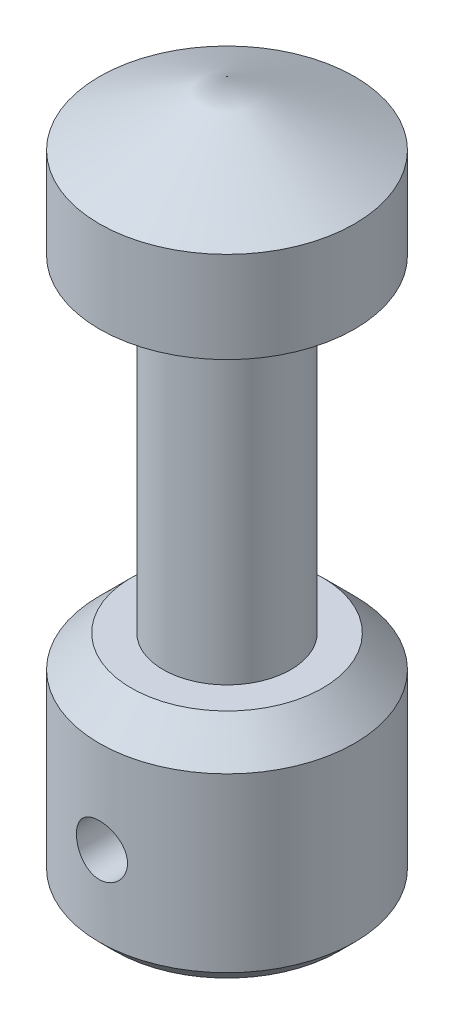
ISO-10303-21;
HEADER;
FILE_DESCRIPTION(('STEP AP214'),'2;1');
FILE_NAME('part.step','',(''),(''),'','','');
FILE_SCHEMA(('AUTOMOTIVE_DESIGN { 1 0 10303 214 1 1 1 1 }'));
ENDSEC;
DATA;
#1=APPLICATION_CONTEXT('core data for automotive mechanical design processes');
#2=APPLICATION_PROTOCOL_DEFINITION('international standard','automotive_design',2000,#1);
#3=PRODUCT_CONTEXT('',#1,'mechanical');
#4=PRODUCT('Part','Part','',(#3));
#5=PRODUCT_RELATED_PRODUCT_CATEGORY('part','',(#4));
#6=PRODUCT_DEFINITION_FORMATION('','',#4);
#7=PRODUCT_DEFINITION_CONTEXT('part definition',#1,'design');
#8=PRODUCT_DEFINITION('design','',#6,#7);
#9=PRODUCT_DEFINITION_SHAPE('','',#8);
#10=(LENGTH_UNIT() NAMED_UNIT(*) SI_UNIT(.MILLI.,.METRE.));
#11=(NAMED_UNIT(*) PLANE_ANGLE_UNIT() SI_UNIT($,.RADIAN.));
#12=(NAMED_UNIT(*) SI_UNIT($,.STERADIAN.) SOLID_ANGLE_UNIT());
#13=UNCERTAINTY_MEASURE_WITH_UNIT(LENGTH_MEASURE(1.E-05),#10,'distance_accuracy_value','');
#14=(GEOMETRIC_REPRESENTATION_CONTEXT(3) GLOBAL_UNCERTAINTY_ASSIGNED_CONTEXT((#13)) GLOBAL_UNIT_ASSIGNED_CONTEXT((#10,
#11,#12)) REPRESENTATION_CONTEXT('',''));
#15=CARTESIAN_POINT('',(0.,0.,0.));
#16=DIRECTION('',(0.,0.,1.));
#17=DIRECTION('',(1.,0.,0.));
#18=AXIS2_PLACEMENT_3D('',#15,#16,#17);
#19=CARTESIAN_POINT('',(0.,-2.,0.));
#20=DIRECTION('',(0.,-1.,0.));
#21=DIRECTION('',(0.,0.,-1.));
#22=AXIS2_PLACEMENT_3D('',#19,#20,#21);
#23=CONICAL_SURFACE('',#22,3.99999999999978,1.10714871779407);
#24=CARTESIAN_POINT('',(0.,0.,3.33066907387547E-13));
#25=VERTEX_POINT('',#24);
#26=VERTEX_LOOP('',#25);
#27=FACE_BOUND('',#26,.T.);
#28=CARTESIAN_POINT('',(0.,-2.,0.));
#29=DIRECTION('',(0.,1.,0.));
#30=DIRECTION('',(0.,0.,1.));
#31=AXIS2_PLACEMENT_3D('',#28,#29,#30);
#32=CIRCLE('',#31,4.);
#33=CARTESIAN_POINT('',(0.,-2.,4.));
#34=VERTEX_POINT('',#33);
#35=EDGE_CURVE('E37',#34,#34,#32,.F.);
#36=ORIENTED_EDGE('',*,*,#35,.F.);
#37=EDGE_LOOP('',(#36));
#38=FACE_BOUND('',#37,.T.);
#39=ADVANCED_FACE('F17',(#27,#38),#23,.T.);
#40=CARTESIAN_POINT('',(0.,0.,0.));
#41=DIRECTION('',(0.,1.,0.));
#42=DIRECTION('',(0.,0.,1.));
#43=AXIS2_PLACEMENT_3D('',#40,#41,#42);
#44=CYLINDRICAL_SURFACE('',#43,4.);
#45=ORIENTED_EDGE('',*,*,#35,.T.);
#46=EDGE_LOOP('',(#45));
#47=FACE_BOUND('',#46,.T.);
#48=CARTESIAN_POINT('',(0.,-4.85738696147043,0.));
#49=DIRECTION('',(0.,1.,0.));
#50=DIRECTION('',(0.,0.,1.));
#51=AXIS2_PLACEMENT_3D('',#48,#49,#50);
#52=CIRCLE('',#51,4.);
#53=CARTESIAN_POINT('',(0.,-4.85738696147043,4.));
#54=VERTEX_POINT('',#53);
#55=EDGE_CURVE('E20',#54,#54,#52,.F.);
#56=ORIENTED_EDGE('',*,*,#55,.F.);
#57=EDGE_LOOP('',(#56));
#58=FACE_BOUND('',#57,.T.);
#59=ADVANCED_FACE('F34',(#47,#58),#44,.T.);
#60=CARTESIAN_POINT('',(-4.,-4.85738696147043,0.));
#61=DIRECTION('',(0.,-1.,0.));
#62=DIRECTION('',(0.,0.,-1.));
#63=AXIS2_PLACEMENT_3D('',#60,#61,#62);
#64=PLANE('',#63);
#65=CARTESIAN_POINT('',(0.,-4.85738696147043,0.));
#66=DIRECTION('',(0.,-1.,0.));
#67=DIRECTION('',(0.,0.,-1.));
#68=AXIS2_PLACEMENT_3D('',#65,#66,#67);
#69=CIRCLE('',#68,2.);
#70=CARTESIAN_POINT('',(0.,-4.85738696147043,-2.));
#71=VERTEX_POINT('',#70);
#72=EDGE_CURVE('E41',#71,#71,#69,.T.);
#73=ORIENTED_EDGE('',*,*,#72,.F.);
#74=EDGE_LOOP('',(#73));
#75=FACE_BOUND('',#74,.T.);
#76=ORIENTED_EDGE('',*,*,#55,.T.);
#77=EDGE_LOOP('',(#76));
#78=FACE_BOUND('',#77,.T.);
#79=ADVANCED_FACE('F127',(#75,#78),#64,.T.);
#80=CARTESIAN_POINT('',(0.,-16.9999999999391,0.));
#81=DIRECTION('',(0.,-1.,0.));
#82=DIRECTION('',(0.,0.,-1.));
#83=AXIS2_PLACEMENT_3D('',#80,#81,#82);
#84=CONICAL_SURFACE('',#83,0.499999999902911,0.443506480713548);
#85=CARTESIAN_POINT('',(0.,-15.9475263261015,0.));
#86=VERTEX_POINT('',#85);
#87=VERTEX_LOOP('',#86);
#88=FACE_BOUND('',#87,.T.);
#89=CARTESIAN_POINT('',(0.,-17.,0.));
#90=DIRECTION('',(0.,1.,0.));
#91=DIRECTION('',(0.,0.,1.));
#92=AXIS2_PLACEMENT_3D('',#89,#90,#91);
#93=CIRCLE('',#92,0.499999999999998);
#94=CARTESIAN_POINT('',(0.,-17.,0.499999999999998));
#95=VERTEX_POINT('',#94);
#96=EDGE_CURVE('E44',#95,#95,#93,.F.);
#97=ORIENTED_EDGE('',*,*,#96,.T.);
#98=EDGE_LOOP('',(#97));
#99=FACE_BOUND('',#98,.T.);
#100=ADVANCED_FACE('F123',(#88,#99),#84,.F.);
#101=CARTESIAN_POINT('',(0.,-21.5,0.));
#102=DIRECTION('',(0.,-1.,0.));
#103=DIRECTION('',(0.,0.,-1.));
#104=AXIS2_PLACEMENT_3D('',#101,#102,#103);
#105=CYLINDRICAL_SURFACE('',#104,2.);
#106=ORIENTED_EDGE('',*,*,#72,.T.);
#107=EDGE_LOOP('',(#106));
#108=FACE_BOUND('',#107,.T.);
#109=CARTESIAN_POINT('',(0.,-15.1028019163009,0.));
#110=DIRECTION('',(0.,-1.,0.));
#111=DIRECTION('',(0.,0.,-1.));
#112=AXIS2_PLACEMENT_3D('',#109,#110,#111);
#113=CIRCLE('',#112,2.);
#114=CARTESIAN_POINT('',(0.,-15.1028019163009,-2.));
#115=VERTEX_POINT('',#114);
#116=EDGE_CURVE('E224',#115,#115,#113,.T.);
#117=ORIENTED_EDGE('',*,*,#116,.F.);
#118=EDGE_LOOP('',(#117));
#119=FACE_BOUND('',#118,.T.);
#120=ADVANCED_FACE('F119',(#108,#119),#105,.T.);
#121=CARTESIAN_POINT('',(0.,0.,0.));
#122=DIRECTION('',(0.,1.,0.));
#123=DIRECTION('',(0.,0.,1.));
#124=AXIS2_PLACEMENT_3D('',#121,#122,#123);
#125=CYLINDRICAL_SURFACE('',#124,0.499999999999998);
#126=CARTESIAN_POINT('',(0.,-18.2,-0.499999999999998));
#127=CARTESIAN_POINT('',(0.025386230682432,-18.2000030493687,-0.499996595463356));
#128=CARTESIAN_POINT('',(0.0508149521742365,-18.2012220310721,-0.498052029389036));
#129=CARTESIAN_POINT('',(0.100908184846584,-18.2059879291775,-0.49037101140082));
#130=CARTESIAN_POINT('',(0.125570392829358,-18.2095412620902,-0.48462410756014));
#131=CARTESIAN_POINT('',(0.173284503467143,-18.2186172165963,-0.469674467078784));
#132=CARTESIAN_POINT('',(0.196344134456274,-18.2241294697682,-0.460489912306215));
#133=CARTESIAN_POINT('',(0.240509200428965,-18.2366632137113,-0.439042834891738));
#134=CARTESIAN_POINT('',(0.261615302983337,-18.2436841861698,-0.426781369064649));
#135=CARTESIAN_POINT('',(0.303188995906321,-18.2593191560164,-0.398445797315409));
#136=CARTESIAN_POINT('',(0.323470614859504,-18.2680156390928,-0.38214524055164));
#137=CARTESIAN_POINT('',(0.361193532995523,-18.2858740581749,-0.346713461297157));
#138=CARTESIAN_POINT('',(0.378630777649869,-18.2950366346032,-0.327578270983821));
#139=CARTESIAN_POINT('',(0.412571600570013,-18.3142783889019,-0.283986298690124));
#140=CARTESIAN_POINT('',(0.428629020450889,-18.3243136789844,-0.259159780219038));
#141=CARTESIAN_POINT('',(0.456296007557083,-18.3426793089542,-0.206573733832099));
#142=CARTESIAN_POINT('',(0.467913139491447,-18.3510125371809,-0.178819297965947));
#143=CARTESIAN_POINT('',(0.48373359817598,-18.3627616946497,-0.128475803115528));
#144=CARTESIAN_POINT('',(0.489078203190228,-18.3668923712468,-0.10641329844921));
#145=CARTESIAN_POINT('',(0.496727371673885,-18.3728745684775,-0.0614776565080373));
#146=CARTESIAN_POINT('',(0.499036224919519,-18.3747293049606,-0.0386057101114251));
#147=CARTESIAN_POINT('',(0.500475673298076,-18.3758804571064,0.00736521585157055));
#148=CARTESIAN_POINT('',(0.499597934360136,-18.3751701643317,0.0304646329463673));
#149=CARTESIAN_POINT('',(0.494705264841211,-18.3712903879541,0.0761240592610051));
#150=CARTESIAN_POINT('',(0.490687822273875,-18.3681189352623,0.0986836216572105));
#151=CARTESIAN_POINT('',(0.47987245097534,-18.3598697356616,0.142175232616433));
#152=CARTESIAN_POINT('',(0.473140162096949,-18.3548372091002,0.163132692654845));
#153=CARTESIAN_POINT('',(0.457160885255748,-18.3434178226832,0.203664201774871));
#154=CARTESIAN_POINT('',(0.447912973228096,-18.3370304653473,0.223237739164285));
#155=CARTESIAN_POINT('',(0.42517897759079,-18.3221803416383,0.264334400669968));
#156=CARTESIAN_POINT('',(0.411223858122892,-18.3135527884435,0.285538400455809));
#157=CARTESIAN_POINT('',(0.380350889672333,-18.2959762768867,0.325533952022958));
#158=CARTESIAN_POINT('',(0.36343028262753,-18.2870270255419,0.344323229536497));
#159=CARTESIAN_POINT('',(0.323814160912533,-18.2680833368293,0.382114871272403));
#160=CARTESIAN_POINT('',(0.300626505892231,-18.2581595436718,0.400642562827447));
#161=CARTESIAN_POINT('',(0.250873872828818,-18.2398926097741,0.433532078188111));
#162=CARTESIAN_POINT('',(0.224308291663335,-18.2315497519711,0.447893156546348));
#163=CARTESIAN_POINT('',(0.169920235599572,-18.2177774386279,0.47112068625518));
#164=CARTESIAN_POINT('',(0.142239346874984,-18.2122168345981,0.480238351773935));
#165=CARTESIAN_POINT('',(0.0853578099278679,-18.204053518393,0.493517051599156));
#166=CARTESIAN_POINT('',(0.0561638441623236,-18.2014387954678,0.497698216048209));
#167=CARTESIAN_POINT('',(0.0179027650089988,-18.2001491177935,0.499760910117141));
#168=CARTESIAN_POINT('',(0.00895402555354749,-18.1999989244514,0.500001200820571));
#169=CARTESIAN_POINT('',(-0.0253862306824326,-18.2000030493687,0.499996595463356));
#170=CARTESIAN_POINT('',(-0.0508149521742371,-18.2012220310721,0.498052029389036));
#171=CARTESIAN_POINT('',(-0.100908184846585,-18.2059879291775,0.49037101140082));
#172=CARTESIAN_POINT('',(-0.125570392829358,-18.2095412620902,0.48462410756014));
#173=CARTESIAN_POINT('',(-0.173284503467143,-18.2186172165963,0.469674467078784));
#174=CARTESIAN_POINT('',(-0.196344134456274,-18.2241294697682,0.460489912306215));
#175=CARTESIAN_POINT('',(-0.240509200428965,-18.2366632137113,0.439042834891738));
#176=CARTESIAN_POINT('',(-0.261615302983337,-18.2436841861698,0.426781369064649));
#177=CARTESIAN_POINT('',(-0.303188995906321,-18.2593191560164,0.398445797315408));
#178=CARTESIAN_POINT('',(-0.323470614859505,-18.2680156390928,0.382145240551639));
#179=CARTESIAN_POINT('',(-0.361193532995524,-18.2858740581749,0.346713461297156));
#180=CARTESIAN_POINT('',(-0.37863077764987,-18.2950366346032,0.32757827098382));
#181=CARTESIAN_POINT('',(-0.412571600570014,-18.3142783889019,0.283986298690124));
#182=CARTESIAN_POINT('',(-0.428629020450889,-18.3243136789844,0.259159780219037));
#183=CARTESIAN_POINT('',(-0.456296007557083,-18.3426793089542,0.206573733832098));
#184=CARTESIAN_POINT('',(-0.467913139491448,-18.3510125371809,0.178819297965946));
#185=CARTESIAN_POINT('',(-0.48373359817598,-18.3627616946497,0.128475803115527));
#186=CARTESIAN_POINT('',(-0.489078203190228,-18.3668923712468,0.106413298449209));
#187=CARTESIAN_POINT('',(-0.496727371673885,-18.3728745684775,0.0614776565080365));
#188=CARTESIAN_POINT('',(-0.499036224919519,-18.3747293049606,0.0386057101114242));
#189=CARTESIAN_POINT('',(-0.500475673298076,-18.3758804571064,-0.00736521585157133));
#190=CARTESIAN_POINT('',(-0.499597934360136,-18.3751701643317,-0.0304646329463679));
#191=CARTESIAN_POINT('',(-0.494705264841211,-18.3712903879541,-0.0761240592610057));
#192=CARTESIAN_POINT('',(-0.490687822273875,-18.3681189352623,-0.0986836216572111));
#193=CARTESIAN_POINT('',(-0.479872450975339,-18.3598697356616,-0.142175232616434));
#194=CARTESIAN_POINT('',(-0.473140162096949,-18.3548372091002,-0.163132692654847));
#195=CARTESIAN_POINT('',(-0.457160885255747,-18.3434178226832,-0.203664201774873));
#196=CARTESIAN_POINT('',(-0.447912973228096,-18.3370304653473,-0.223237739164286));
#197=CARTESIAN_POINT('',(-0.42517897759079,-18.3221803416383,-0.264334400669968));
#198=CARTESIAN_POINT('',(-0.411223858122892,-18.3135527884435,-0.285538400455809));
#199=CARTESIAN_POINT('',(-0.380350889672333,-18.2959762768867,-0.325533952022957));
#200=CARTESIAN_POINT('',(-0.36343028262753,-18.2870270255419,-0.344323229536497));
#201=CARTESIAN_POINT('',(-0.323814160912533,-18.2680833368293,-0.382114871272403));
#202=CARTESIAN_POINT('',(-0.30062650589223,-18.2581595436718,-0.400642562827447));
#203=CARTESIAN_POINT('',(-0.250873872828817,-18.2398926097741,-0.433532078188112));
#204=CARTESIAN_POINT('',(-0.224308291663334,-18.2315497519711,-0.447893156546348));
#205=CARTESIAN_POINT('',(-0.169920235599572,-18.2177774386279,-0.47112068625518));
#206=CARTESIAN_POINT('',(-0.142239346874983,-18.2122168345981,-0.480238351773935));
#207=CARTESIAN_POINT('',(-0.0853578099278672,-18.204053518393,-0.493517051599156));
#208=CARTESIAN_POINT('',(-0.0561638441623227,-18.2014387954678,-0.497698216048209));
#209=CARTESIAN_POINT('',(-0.0179027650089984,-18.2001491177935,-0.499760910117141));
#210=CARTESIAN_POINT('',(-0.00895402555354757,-18.1999989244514,-0.500001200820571));
#211=CARTESIAN_POINT('',(0.,-18.2,-0.499999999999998));
#212=B_SPLINE_CURVE_WITH_KNOTS('',3,(#126,#127,#128,#129,#130,#131,#132,#133,#134,#135,#136,
#137,#138,#139,#140,#141,#142,#143,#144,#145,#146,#147,#148,#149,#150,#151,#152,#153,#154,#155,
#156,#157,#158,#159,#160,#161,#162,#163,#164,#165,#166,#167,#168,#169,#170,#171,#172,#173,#174,
#175,#176,#177,#178,#179,#180,#181,#182,#183,#184,#185,#186,#187,#188,#189,#190,#191,#192,#193,
#194,#195,#196,#197,#198,#199,#200,#201,#202,#203,#204,#205,#206,#207,#208,#209,#210,#211),
.UNSPECIFIED.,.T.,.F.,(4,2,2,2,2,2,2,2,2,2,2,2,2,2,2,2,2,2,2,2,2,2,2,2,2,2,2,2,2,2,2,2,2,2,2,2,
2,2,2,2,2,2,4),(0.,0.0761325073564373,0.152475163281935,0.228419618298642,0.304338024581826,
0.38632633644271,0.468430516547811,0.561652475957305,0.654714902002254,0.723647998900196,
0.792483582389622,0.861499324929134,0.930570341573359,0.998062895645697,1.06558027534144,
1.14571372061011,1.22592209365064,1.31934197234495,1.41277855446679,1.501255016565,
1.58936942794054,1.61622226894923,1.69235477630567,1.76869743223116,1.84464188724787,
1.92056029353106,2.00254860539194,2.08465278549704,2.17787474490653,2.27093717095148,
2.33987026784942,2.40870585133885,2.47772159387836,2.54679261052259,2.61428516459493,
2.68180254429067,2.76193598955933,2.84214436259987,2.93556424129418,3.02900082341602,
3.11747728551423,3.20559169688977,3.23244453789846),.UNSPECIFIED.);
#213=CARTESIAN_POINT('',(0.,-18.2,-0.499999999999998));
#214=VERTEX_POINT('',#213);
#215=EDGE_CURVE('E104',#214,#214,#212,.T.);
#216=ORIENTED_EDGE('',*,*,#215,.T.);
#217=EDGE_LOOP('',(#216));
#218=FACE_BOUND('',#217,.T.);
#219=ORIENTED_EDGE('',*,*,#96,.F.);
#220=EDGE_LOOP('',(#219));
#221=FACE_BOUND('',#220,.T.);
#222=ADVANCED_FACE('F114',(#218,#221),#125,.F.);
#223=CARTESIAN_POINT('',(0.,0.,0.));
#224=DIRECTION('',(0.,1.,0.));
#225=DIRECTION('',(0.,0.,1.));
#226=AXIS2_PLACEMENT_3D('',#223,#224,#225);
#227=CYLINDRICAL_SURFACE('',#226,0.499999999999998);
#228=CARTESIAN_POINT('',(0.,-19.8,-0.499999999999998));
#229=CARTESIAN_POINT('',(-0.0253862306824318,-19.7999969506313,-0.499996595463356));
#230=CARTESIAN_POINT('',(-0.0508149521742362,-19.7987779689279,-0.498052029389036));
#231=CARTESIAN_POINT('',(-0.100908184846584,-19.7940120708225,-0.49037101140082));
#232=CARTESIAN_POINT('',(-0.125570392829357,-19.7904587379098,-0.48462410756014));
#233=CARTESIAN_POINT('',(-0.173284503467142,-19.7813827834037,-0.469674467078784));
#234=CARTESIAN_POINT('',(-0.196344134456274,-19.7758705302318,-0.460489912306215));
#235=CARTESIAN_POINT('',(-0.240509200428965,-19.7633367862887,-0.439042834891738));
#236=CARTESIAN_POINT('',(-0.261615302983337,-19.7563158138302,-0.426781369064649));
#237=CARTESIAN_POINT('',(-0.303188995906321,-19.7406808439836,-0.398445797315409));
#238=CARTESIAN_POINT('',(-0.323470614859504,-19.7319843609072,-0.38214524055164));
#239=CARTESIAN_POINT('',(-0.361193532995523,-19.7141259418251,-0.346713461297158));
#240=CARTESIAN_POINT('',(-0.378630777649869,-19.7049633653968,-0.327578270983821));
#241=CARTESIAN_POINT('',(-0.412571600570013,-19.6857216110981,-0.283986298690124));
#242=CARTESIAN_POINT('',(-0.428629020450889,-19.6756863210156,-0.259159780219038));
#243=CARTESIAN_POINT('',(-0.456296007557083,-19.6573206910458,-0.206573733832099));
#244=CARTESIAN_POINT('',(-0.467913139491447,-19.6489874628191,-0.178819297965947));
#245=CARTESIAN_POINT('',(-0.48373359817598,-19.6372383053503,-0.128475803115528));
#246=CARTESIAN_POINT('',(-0.489078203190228,-19.6331076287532,-0.106413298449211));
#247=CARTESIAN_POINT('',(-0.496727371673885,-19.6271254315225,-0.0614776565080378));
#248=CARTESIAN_POINT('',(-0.499036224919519,-19.6252706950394,-0.0386057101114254));
#249=CARTESIAN_POINT('',(-0.500475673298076,-19.6241195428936,0.00736521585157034));
#250=CARTESIAN_POINT('',(-0.499597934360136,-19.6248298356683,0.0304646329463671));
#251=CARTESIAN_POINT('',(-0.494705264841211,-19.6287096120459,0.0761240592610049));
#252=CARTESIAN_POINT('',(-0.490687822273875,-19.6318810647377,0.0986836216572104));
#253=CARTESIAN_POINT('',(-0.47987245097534,-19.6401302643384,0.142175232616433));
#254=CARTESIAN_POINT('',(-0.47314016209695,-19.6451627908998,0.163132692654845));
#255=CARTESIAN_POINT('',(-0.457160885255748,-19.6565821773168,0.203664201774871));
#256=CARTESIAN_POINT('',(-0.447912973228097,-19.6629695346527,0.223237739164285));
#257=CARTESIAN_POINT('',(-0.42517897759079,-19.6778196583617,0.264334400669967));
#258=CARTESIAN_POINT('',(-0.411223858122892,-19.6864472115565,0.285538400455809));
#259=CARTESIAN_POINT('',(-0.380350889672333,-19.7040237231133,0.325533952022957));
#260=CARTESIAN_POINT('',(-0.36343028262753,-19.7129729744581,0.344323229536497));
#261=CARTESIAN_POINT('',(-0.323814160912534,-19.7319166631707,0.382114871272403));
#262=CARTESIAN_POINT('',(-0.300626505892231,-19.7418404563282,0.400642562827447));
#263=CARTESIAN_POINT('',(-0.250873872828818,-19.7601073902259,0.433532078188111));
#264=CARTESIAN_POINT('',(-0.224308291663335,-19.7684502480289,0.447893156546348));
#265=CARTESIAN_POINT('',(-0.169920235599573,-19.7822225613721,0.47112068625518));
#266=CARTESIAN_POINT('',(-0.142239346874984,-19.7877831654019,0.480238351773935));
#267=CARTESIAN_POINT('',(-0.0853578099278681,-19.795946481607,0.493517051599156));
#268=CARTESIAN_POINT('',(-0.0561638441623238,-19.7985612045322,0.497698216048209));
#269=CARTESIAN_POINT('',(-0.017902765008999,-19.7998508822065,0.499760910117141));
#270=CARTESIAN_POINT('',(-0.0089540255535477,-19.8000010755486,0.500001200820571));
#271=CARTESIAN_POINT('',(0.0253862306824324,-19.7999969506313,0.499996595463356));
#272=CARTESIAN_POINT('',(0.0508149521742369,-19.7987779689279,0.498052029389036));
#273=CARTESIAN_POINT('',(0.100908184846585,-19.7940120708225,0.49037101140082));
#274=CARTESIAN_POINT('',(0.125570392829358,-19.7904587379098,0.48462410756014));
#275=CARTESIAN_POINT('',(0.173284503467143,-19.7813827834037,0.469674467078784));
#276=CARTESIAN_POINT('',(0.196344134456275,-19.7758705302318,0.460489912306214));
#277=CARTESIAN_POINT('',(0.240509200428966,-19.7633367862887,0.439042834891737));
#278=CARTESIAN_POINT('',(0.261615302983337,-19.7563158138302,0.426781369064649));
#279=CARTESIAN_POINT('',(0.303188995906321,-19.7406808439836,0.398445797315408));
#280=CARTESIAN_POINT('',(0.323470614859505,-19.7319843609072,0.382145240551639));
#281=CARTESIAN_POINT('',(0.361193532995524,-19.7141259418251,0.346713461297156));
#282=CARTESIAN_POINT('',(0.37863077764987,-19.7049633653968,0.32757827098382));
#283=CARTESIAN_POINT('',(0.412571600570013,-19.6857216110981,0.283986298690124));
#284=CARTESIAN_POINT('',(0.428629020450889,-19.6756863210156,0.259159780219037));
#285=CARTESIAN_POINT('',(0.456296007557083,-19.6573206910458,0.206573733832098));
#286=CARTESIAN_POINT('',(0.467913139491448,-19.6489874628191,0.178819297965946));
#287=CARTESIAN_POINT('',(0.48373359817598,-19.6372383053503,0.128475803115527));
#288=CARTESIAN_POINT('',(0.489078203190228,-19.6331076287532,0.106413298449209));
#289=CARTESIAN_POINT('',(0.496727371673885,-19.6271254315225,0.0614776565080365));
#290=CARTESIAN_POINT('',(0.499036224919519,-19.6252706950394,0.0386057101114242));
#291=CARTESIAN_POINT('',(0.500475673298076,-19.6241195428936,-0.00736521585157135));
#292=CARTESIAN_POINT('',(0.499597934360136,-19.6248298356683,-0.0304646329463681));
#293=CARTESIAN_POINT('',(0.49470526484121,-19.6287096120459,-0.0761240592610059));
#294=CARTESIAN_POINT('',(0.490687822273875,-19.6318810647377,-0.0986836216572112));
#295=CARTESIAN_POINT('',(0.479872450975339,-19.6401302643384,-0.142175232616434));
#296=CARTESIAN_POINT('',(0.473140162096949,-19.6451627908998,-0.163132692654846));
#297=CARTESIAN_POINT('',(0.457160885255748,-19.6565821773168,-0.203664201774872));
#298=CARTESIAN_POINT('',(0.447912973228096,-19.6629695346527,-0.223237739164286));
#299=CARTESIAN_POINT('',(0.42517897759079,-19.6778196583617,-0.264334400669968));
#300=CARTESIAN_POINT('',(0.411223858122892,-19.6864472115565,-0.285538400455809));
#301=CARTESIAN_POINT('',(0.380350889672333,-19.7040237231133,-0.325533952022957));
#302=CARTESIAN_POINT('',(0.363430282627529,-19.7129729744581,-0.344323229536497));
#303=CARTESIAN_POINT('',(0.323814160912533,-19.7319166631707,-0.382114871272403));
#304=CARTESIAN_POINT('',(0.30062650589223,-19.7418404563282,-0.400642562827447));
#305=CARTESIAN_POINT('',(0.250873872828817,-19.7601073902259,-0.433532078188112));
#306=CARTESIAN_POINT('',(0.224308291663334,-19.7684502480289,-0.447893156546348));
#307=CARTESIAN_POINT('',(0.169920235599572,-19.7822225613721,-0.47112068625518));
#308=CARTESIAN_POINT('',(0.142239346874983,-19.7877831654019,-0.480238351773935));
#309=CARTESIAN_POINT('',(0.085357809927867,-19.795946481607,-0.493517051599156));
#310=CARTESIAN_POINT('',(0.0561638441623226,-19.7985612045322,-0.497698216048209));
#311=CARTESIAN_POINT('',(0.0179027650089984,-19.7998508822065,-0.499760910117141));
#312=CARTESIAN_POINT('',(0.00895402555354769,-19.8000010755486,-0.500001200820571));
#313=CARTESIAN_POINT('',(0.,-19.8,-0.499999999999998));
#314=B_SPLINE_CURVE_WITH_KNOTS('',3,(#228,#229,#230,#231,#232,#233,#234,#235,#236,#237,#238,
#239,#240,#241,#242,#243,#244,#245,#246,#247,#248,#249,#250,#251,#252,#253,#254,#255,#256,#257,
#258,#259,#260,#261,#262,#263,#264,#265,#266,#267,#268,#269,#270,#271,#272,#273,#274,#275,#276,
#277,#278,#279,#280,#281,#282,#283,#284,#285,#286,#287,#288,#289,#290,#291,#292,#293,#294,#295,
#296,#297,#298,#299,#300,#301,#302,#303,#304,#305,#306,#307,#308,#309,#310,#311,#312,#313),
.UNSPECIFIED.,.T.,.F.,(4,2,2,2,2,2,2,2,2,2,2,2,2,2,2,2,2,2,2,2,2,2,2,2,2,2,2,2,2,2,2,2,2,2,2,2,
2,2,2,2,2,2,4),(0.,0.0761325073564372,0.152475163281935,0.228419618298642,0.304338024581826,
0.38632633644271,0.468430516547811,0.561652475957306,0.654714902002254,0.723647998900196,
0.792483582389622,0.861499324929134,0.930570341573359,0.998062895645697,1.06558027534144,
1.14571372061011,1.22592209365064,1.31934197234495,1.41277855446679,1.501255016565,
1.58936942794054,1.61622226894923,1.69235477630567,1.76869743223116,1.84464188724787,
1.92056029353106,2.00254860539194,2.08465278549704,2.17787474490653,2.27093717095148,
2.33987026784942,2.40870585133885,2.47772159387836,2.54679261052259,2.61428516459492,
2.68180254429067,2.76193598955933,2.84214436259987,2.93556424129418,3.02900082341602,
3.11747728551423,3.20559169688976,3.23244453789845),.UNSPECIFIED.);
#315=CARTESIAN_POINT('',(0.,-19.8,-0.499999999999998));
#316=VERTEX_POINT('',#315);
#317=EDGE_CURVE('E96',#316,#316,#314,.T.);
#318=ORIENTED_EDGE('',*,*,#317,.T.);
#319=EDGE_LOOP('',(#318));
#320=FACE_BOUND('',#319,.T.);
#321=CARTESIAN_POINT('',(0.,-22.,0.));
#322=DIRECTION('',(0.,1.,0.));
#323=DIRECTION('',(0.,0.,1.));
#324=AXIS2_PLACEMENT_3D('',#321,#322,#323);
#325=CIRCLE('',#324,0.499999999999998);
#326=CARTESIAN_POINT('',(0.,-22.,0.499999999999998));
#327=VERTEX_POINT('',#326);
#328=EDGE_CURVE('E226',#327,#327,#325,.T.);
#329=ORIENTED_EDGE('',*,*,#328,.F.);
#330=EDGE_LOOP('',(#329));
#331=FACE_BOUND('',#330,.T.);
#332=ADVANCED_FACE('F109',(#320,#331),#227,.F.);
#333=CARTESIAN_POINT('',(-0.499999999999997,-22.,0.));
#334=DIRECTION('',(0.,-1.,0.));
#335=DIRECTION('',(0.,0.,-1.));
#336=AXIS2_PLACEMENT_3D('',#333,#334,#335);
#337=PLANE('',#336);
#338=ORIENTED_EDGE('',*,*,#328,.T.);
#339=EDGE_LOOP('',(#338));
#340=FACE_BOUND('',#339,.T.);
#341=CARTESIAN_POINT('',(0.,-21.9999999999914,0.));
#342=DIRECTION('',(0.,1.,0.));
#343=DIRECTION('',(0.,0.,1.));
#344=AXIS2_PLACEMENT_3D('',#341,#342,#343);
#345=CIRCLE('',#344,3.49999999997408);
#346=CARTESIAN_POINT('',(0.,-21.9999999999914,3.49999999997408));
#347=VERTEX_POINT('',#346);
#348=EDGE_CURVE('E82',#347,#347,#345,.T.);
#349=ORIENTED_EDGE('',*,*,#348,.F.);
#350=EDGE_LOOP('',(#349));
#351=FACE_BOUND('',#350,.T.);
#352=ADVANCED_FACE('F113',(#340,#351),#337,.T.);
#353=CARTESIAN_POINT('',(-4.,-15.1028019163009,0.));
#354=DIRECTION('',(0.,1.,0.));
#355=DIRECTION('',(0.,0.,1.));
#356=AXIS2_PLACEMENT_3D('',#353,#354,#355);
#357=PLANE('',#356);
#358=ORIENTED_EDGE('',*,*,#116,.T.);
#359=EDGE_LOOP('',(#358));
#360=FACE_BOUND('',#359,.T.);
#361=CARTESIAN_POINT('',(0.,-15.1028019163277,0.));
#362=DIRECTION('',(0.,-1.,0.));
#363=DIRECTION('',(0.,0.,-1.));
#364=AXIS2_PLACEMENT_3D('',#361,#362,#363);
#365=CIRCLE('',#364,3.00000000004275);
#366=CARTESIAN_POINT('',(0.,-15.1028019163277,-3.00000000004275));
#367=VERTEX_POINT('',#366);
#368=EDGE_CURVE('E93',#367,#367,#365,.T.);
#369=ORIENTED_EDGE('',*,*,#368,.F.);
#370=EDGE_LOOP('',(#369));
#371=FACE_BOUND('',#370,.T.);
#372=ADVANCED_FACE('F77',(#360,#371),#357,.T.);
#373=CARTESIAN_POINT('',(0.,-19.,-4.));
#374=DIRECTION('',(0.,0.,1.));
#375=DIRECTION('',(1.,0.,0.));
#376=AXIS2_PLACEMENT_3D('',#373,#374,#375);
#377=CYLINDRICAL_SURFACE('',#376,0.8);
#378=CARTESIAN_POINT('',(0.,-18.2,4.));
#379=CARTESIAN_POINT('',(0.0444528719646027,-18.2000019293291,3.99999903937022));
#380=CARTESIAN_POINT('',(0.088932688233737,-18.2037183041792,3.99925121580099));
#381=CARTESIAN_POINT('',(0.176641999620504,-18.2184762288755,3.99633945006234));
#382=CARTESIAN_POINT('',(0.219870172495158,-18.229525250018,3.99417406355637));
#383=CARTESIAN_POINT('',(0.303785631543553,-18.2585936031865,3.98866907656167));
#384=CARTESIAN_POINT('',(0.344475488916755,-18.2766057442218,3.98533068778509));
#385=CARTESIAN_POINT('',(0.422249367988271,-18.3190677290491,3.97784286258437));
#386=CARTESIAN_POINT('',(0.459333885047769,-18.3435166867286,3.97369353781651));
#387=CARTESIAN_POINT('',(0.529350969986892,-18.3985077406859,3.96497779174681));
#388=CARTESIAN_POINT('',(0.562228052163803,-18.4291197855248,3.96040694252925));
#389=CARTESIAN_POINT('',(0.622423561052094,-18.4954265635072,3.951394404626));
#390=CARTESIAN_POINT('',(0.649740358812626,-18.531122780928,3.9469527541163));
#391=CARTESIAN_POINT('',(0.698278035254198,-18.6069917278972,3.93865733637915));
#392=CARTESIAN_POINT('',(0.71943843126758,-18.6472038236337,3.93480956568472));
#393=CARTESIAN_POINT('',(0.754659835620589,-18.7306753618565,3.92820730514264));
#394=CARTESIAN_POINT('',(0.768728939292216,-18.7739312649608,3.9254515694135));
#395=CARTESIAN_POINT('',(0.785993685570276,-18.847845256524,3.92202265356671));
#396=CARTESIAN_POINT('',(0.791237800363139,-18.8780229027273,3.92096360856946));
#397=CARTESIAN_POINT('',(0.798241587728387,-18.9387961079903,3.91954372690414));
#398=CARTESIAN_POINT('',(0.800001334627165,-18.9693916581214,3.91918287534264));
#399=CARTESIAN_POINT('',(0.799998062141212,-19.0444428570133,3.91918462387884));
#400=CARTESIAN_POINT('',(0.796283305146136,-19.0889126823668,3.91994793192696));
#401=CARTESIAN_POINT('',(0.78153239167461,-19.176601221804,3.92291491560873));
#402=CARTESIAN_POINT('',(0.770488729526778,-19.2198186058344,3.92512006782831));
#403=CARTESIAN_POINT('',(0.74143604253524,-19.3037112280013,3.93071110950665));
#404=CARTESIAN_POINT('',(0.723434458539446,-19.3443891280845,3.93409573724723));
#405=CARTESIAN_POINT('',(0.680997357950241,-19.4221428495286,3.94166271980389));
#406=CARTESIAN_POINT('',(0.656562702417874,-19.4592191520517,3.94584496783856));
#407=CARTESIAN_POINT('',(0.601586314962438,-19.5292449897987,3.954601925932));
#408=CARTESIAN_POINT('',(0.570971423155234,-19.5621365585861,3.95918092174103));
#409=CARTESIAN_POINT('',(0.504652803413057,-19.6223601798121,3.96817882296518));
#410=CARTESIAN_POINT('',(0.468947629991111,-19.6496906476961,3.97259768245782));
#411=CARTESIAN_POINT('',(0.393070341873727,-19.6982430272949,3.98082454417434));
#412=CARTESIAN_POINT('',(0.352860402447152,-19.7194068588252,3.98462659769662));
#413=CARTESIAN_POINT('',(0.269393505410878,-19.7546352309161,3.99113669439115));
#414=CARTESIAN_POINT('',(0.226140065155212,-19.76870781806,3.99384597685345));
#415=CARTESIAN_POINT('',(0.152216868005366,-19.7859821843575,3.99721451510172));
#416=CARTESIAN_POINT('',(0.122026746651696,-19.7912306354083,3.99825387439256));
#417=CARTESIAN_POINT('',(0.0612286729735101,-19.7982401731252,3.99964694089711));
#418=CARTESIAN_POINT('',(0.0306207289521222,-19.8000013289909,4.00000066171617));
#419=CARTESIAN_POINT('',(-0.0444528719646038,-19.7999980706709,3.99999903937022));
#420=CARTESIAN_POINT('',(-0.0889326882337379,-19.7962816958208,3.99925121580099));
#421=CARTESIAN_POINT('',(-0.176641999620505,-19.7815237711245,3.99633945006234));
#422=CARTESIAN_POINT('',(-0.219870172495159,-19.770474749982,3.99417406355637));
#423=CARTESIAN_POINT('',(-0.303785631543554,-19.7414063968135,3.98866907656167));
#424=CARTESIAN_POINT('',(-0.344475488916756,-19.7233942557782,3.98533068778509));
#425=CARTESIAN_POINT('',(-0.422249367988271,-19.6809322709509,3.97784286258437));
#426=CARTESIAN_POINT('',(-0.459333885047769,-19.6564833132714,3.97369353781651));
#427=CARTESIAN_POINT('',(-0.529350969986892,-19.6014922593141,3.96497779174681));
#428=CARTESIAN_POINT('',(-0.562228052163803,-19.5708802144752,3.96040694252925));
#429=CARTESIAN_POINT('',(-0.622423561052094,-19.5045734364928,3.951394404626));
#430=CARTESIAN_POINT('',(-0.649740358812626,-19.468877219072,3.9469527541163));
#431=CARTESIAN_POINT('',(-0.698278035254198,-19.3930082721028,3.93865733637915));
#432=CARTESIAN_POINT('',(-0.71943843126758,-19.3527961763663,3.93480956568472));
#433=CARTESIAN_POINT('',(-0.754659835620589,-19.2693246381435,3.92820730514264));
#434=CARTESIAN_POINT('',(-0.768728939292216,-19.2260687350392,3.9254515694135));
#435=CARTESIAN_POINT('',(-0.785993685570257,-19.1521547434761,3.92202265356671));
#436=CARTESIAN_POINT('',(-0.79123780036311,-19.1219770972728,3.92096360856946));
#437=CARTESIAN_POINT('',(-0.798241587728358,-19.06120389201,3.91954372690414));
#438=CARTESIAN_POINT('',(-0.800001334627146,-19.030608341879,3.91918287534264));
#439=CARTESIAN_POINT('',(-0.799998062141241,-18.9555571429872,3.91918462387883));
#440=CARTESIAN_POINT('',(-0.796283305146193,-18.9110873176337,3.91994793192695));
#441=CARTESIAN_POINT('',(-0.781532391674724,-18.8233987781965,3.9229149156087));
#442=CARTESIAN_POINT('',(-0.770488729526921,-18.7801813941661,3.92512006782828));
#443=CARTESIAN_POINT('',(-0.741436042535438,-18.6962887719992,3.93071110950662));
#444=CARTESIAN_POINT('',(-0.723434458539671,-18.655610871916,3.93409573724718));
#445=CARTESIAN_POINT('',(-0.680997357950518,-18.5778571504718,3.94166271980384));
#446=CARTESIAN_POINT('',(-0.656562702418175,-18.5407808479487,3.94584496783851));
#447=CARTESIAN_POINT('',(-0.601586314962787,-18.4707550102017,3.95460192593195));
#448=CARTESIAN_POINT('',(-0.570971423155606,-18.4378634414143,3.95918092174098));
#449=CARTESIAN_POINT('',(-0.504652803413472,-18.3776398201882,3.96817882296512));
#450=CARTESIAN_POINT('',(-0.468947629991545,-18.3503093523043,3.97259768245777));
#451=CARTESIAN_POINT('',(-0.393070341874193,-18.3017569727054,3.9808245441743));
#452=CARTESIAN_POINT('',(-0.352860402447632,-18.2805931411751,3.98462659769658));
#453=CARTESIAN_POINT('',(-0.269393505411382,-18.2453647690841,3.99113669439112));
#454=CARTESIAN_POINT('',(-0.226140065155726,-18.2312921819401,3.99384597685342));
#455=CARTESIAN_POINT('',(-0.152216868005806,-18.2140178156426,3.99721451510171));
#456=CARTESIAN_POINT('',(-0.12202674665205,-18.2087693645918,3.99825387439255));
#457=CARTESIAN_POINT('',(-0.0612286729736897,-18.2017598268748,3.99964694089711));
#458=CARTESIAN_POINT('',(-0.0306207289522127,-18.1999986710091,4.00000066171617));
#459=CARTESIAN_POINT('',(0.,-18.2,4.));
#460=B_SPLINE_CURVE_WITH_KNOTS('',3,(#378,#379,#380,#381,#382,#383,#384,#385,#386,#387,#388,
#389,#390,#391,#392,#393,#394,#395,#396,#397,#398,#399,#400,#401,#402,#403,#404,#405,#406,#407,
#408,#409,#410,#411,#412,#413,#414,#415,#416,#417,#418,#419,#420,#421,#422,#423,#424,#425,#426,
#427,#428,#429,#430,#431,#432,#433,#434,#435,#436,#437,#438,#439,#440,#441,#442,#443,#444,#445,
#446,#447,#448,#449,#450,#451,#452,#453,#454,#455,#456,#457,#458,#459),.UNSPECIFIED.,.T.,.F.,(4,
2,2,2,2,2,2,2,2,2,2,2,2,2,2,2,2,2,2,2,2,2,2,2,2,2,2,2,2,2,2,2,2,2,2,2,2,2,2,2,4),(0.,
0.133245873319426,0.266627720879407,0.399872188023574,0.53309832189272,0.667931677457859,
0.802804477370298,0.93896073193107,1.07496119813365,1.16671049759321,1.25845783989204,
1.39167361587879,1.52502603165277,1.65823623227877,1.79142861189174,1.9263013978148,
2.06121256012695,2.19735609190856,2.33334478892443,2.42513113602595,2.5169156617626,
2.65016153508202,2.783543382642,2.91678784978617,3.05001398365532,3.18484733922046,
3.31972013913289,3.45587639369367,3.59187685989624,3.68362615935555,3.77537350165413,
3.90858927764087,4.04194169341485,4.17515189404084,4.30834427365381,4.44321705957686,
4.57812822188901,4.71427175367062,4.85026045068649,4.94204679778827,5.03383132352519),.UNSPECIFIED.);
#461=CARTESIAN_POINT('',(0.,-18.2,4.));
#462=VERTEX_POINT('',#461);
#463=EDGE_CURVE('E46',#462,#462,#460,.T.);
#464=ORIENTED_EDGE('',*,*,#463,.F.);
#465=EDGE_LOOP('',(#464));
#466=FACE_BOUND('',#465,.T.);
#467=CARTESIAN_POINT('',(0.8,-18.9999999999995,-3.91918358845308));
#468=CARTESIAN_POINT('',(0.799998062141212,-18.9555571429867,-3.91918462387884));
#469=CARTESIAN_POINT('',(0.796283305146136,-18.9110873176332,-3.91994793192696));
#470=CARTESIAN_POINT('',(0.78153239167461,-18.823398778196,-3.92291491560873));
#471=CARTESIAN_POINT('',(0.770488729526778,-18.7801813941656,-3.92512006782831));
#472=CARTESIAN_POINT('',(0.74143604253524,-18.6962887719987,-3.93071110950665));
#473=CARTESIAN_POINT('',(0.723434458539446,-18.6556108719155,-3.93409573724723));
#474=CARTESIAN_POINT('',(0.680997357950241,-18.5778571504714,-3.94166271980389));
#475=CARTESIAN_POINT('',(0.656562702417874,-18.5407808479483,-3.94584496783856));
#476=CARTESIAN_POINT('',(0.601586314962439,-18.4707550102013,-3.954601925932));
#477=CARTESIAN_POINT('',(0.570971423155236,-18.4378634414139,-3.95918092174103));
#478=CARTESIAN_POINT('',(0.504652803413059,-18.3776398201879,-3.96817882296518));
#479=CARTESIAN_POINT('',(0.468947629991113,-18.3503093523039,-3.97259768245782));
#480=CARTESIAN_POINT('',(0.393070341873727,-18.3017569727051,-3.98082454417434));
#481=CARTESIAN_POINT('',(0.352860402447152,-18.2805931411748,-3.98462659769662));
#482=CARTESIAN_POINT('',(0.269393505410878,-18.2453647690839,-3.99113669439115));
#483=CARTESIAN_POINT('',(0.226140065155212,-18.23129218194,-3.99384597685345));
#484=CARTESIAN_POINT('',(0.152216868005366,-18.2140178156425,-3.99721451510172));
#485=CARTESIAN_POINT('',(0.122026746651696,-18.2087693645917,-3.99825387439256));
#486=CARTESIAN_POINT('',(0.0612286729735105,-18.2017598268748,-3.99964694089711));
#487=CARTESIAN_POINT('',(0.0306207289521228,-18.1999986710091,-4.00000066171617));
#488=CARTESIAN_POINT('',(-0.0444528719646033,-18.2000019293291,-3.99999903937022));
#489=CARTESIAN_POINT('',(-0.0889326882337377,-18.2037183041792,-3.99925121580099));
#490=CARTESIAN_POINT('',(-0.176641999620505,-18.2184762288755,-3.99633945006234));
#491=CARTESIAN_POINT('',(-0.219870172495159,-18.229525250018,-3.99417406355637));
#492=CARTESIAN_POINT('',(-0.303785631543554,-18.2585936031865,-3.98866907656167));
#493=CARTESIAN_POINT('',(-0.344475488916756,-18.2766057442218,-3.98533068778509));
#494=CARTESIAN_POINT('',(-0.422249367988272,-18.3190677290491,-3.97784286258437));
#495=CARTESIAN_POINT('',(-0.459333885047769,-18.3435166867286,-3.97369353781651));
#496=CARTESIAN_POINT('',(-0.529350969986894,-18.3985077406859,-3.96497779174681));
#497=CARTESIAN_POINT('',(-0.562228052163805,-18.4291197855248,-3.96040694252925));
#498=CARTESIAN_POINT('',(-0.622423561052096,-18.4954265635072,-3.951394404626));
#499=CARTESIAN_POINT('',(-0.649740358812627,-18.531122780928,-3.9469527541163));
#500=CARTESIAN_POINT('',(-0.698278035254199,-18.6069917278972,-3.93865733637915));
#501=CARTESIAN_POINT('',(-0.719438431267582,-18.6472038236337,-3.93480956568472));
#502=CARTESIAN_POINT('',(-0.75465983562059,-18.7306753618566,-3.92820730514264));
#503=CARTESIAN_POINT('',(-0.768728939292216,-18.7739312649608,-3.9254515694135));
#504=CARTESIAN_POINT('',(-0.785993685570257,-18.8478452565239,-3.92202265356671));
#505=CARTESIAN_POINT('',(-0.79123780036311,-18.8780229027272,-3.92096360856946));
#506=CARTESIAN_POINT('',(-0.798241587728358,-18.93879610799,-3.91954372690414));
#507=CARTESIAN_POINT('',(-0.800001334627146,-18.969391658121,-3.91918287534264));
#508=CARTESIAN_POINT('',(-0.799998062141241,-19.0444428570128,-3.91918462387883));
#509=CARTESIAN_POINT('',(-0.796283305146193,-19.0889126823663,-3.91994793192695));
#510=CARTESIAN_POINT('',(-0.781532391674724,-19.1766012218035,-3.9229149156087));
#511=CARTESIAN_POINT('',(-0.770488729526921,-19.2198186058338,-3.92512006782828));
#512=CARTESIAN_POINT('',(-0.741436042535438,-19.3037112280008,-3.93071110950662));
#513=CARTESIAN_POINT('',(-0.723434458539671,-19.344389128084,-3.93409573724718));
#514=CARTESIAN_POINT('',(-0.680997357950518,-19.4221428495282,-3.94166271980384));
#515=CARTESIAN_POINT('',(-0.656562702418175,-19.4592191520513,-3.94584496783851));
#516=CARTESIAN_POINT('',(-0.601586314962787,-19.5292449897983,-3.95460192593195));
#517=CARTESIAN_POINT('',(-0.570971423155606,-19.5621365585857,-3.95918092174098));
#518=CARTESIAN_POINT('',(-0.504652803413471,-19.6223601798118,-3.96817882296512));
#519=CARTESIAN_POINT('',(-0.468947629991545,-19.6496906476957,-3.97259768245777));
#520=CARTESIAN_POINT('',(-0.393070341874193,-19.6982430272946,-3.9808245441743));
#521=CARTESIAN_POINT('',(-0.352860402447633,-19.7194068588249,-3.98462659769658));
#522=CARTESIAN_POINT('',(-0.269393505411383,-19.7546352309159,-3.99113669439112));
#523=CARTESIAN_POINT('',(-0.226140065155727,-19.7687078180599,-3.99384597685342));
#524=CARTESIAN_POINT('',(-0.152216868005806,-19.7859821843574,-3.99721451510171));
#525=CARTESIAN_POINT('',(-0.12202674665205,-19.7912306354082,-3.99825387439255));
#526=CARTESIAN_POINT('',(-0.0612286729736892,-19.7982401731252,-3.99964694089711));
#527=CARTESIAN_POINT('',(-0.0306207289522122,-19.8000013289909,-4.00000066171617));
#528=CARTESIAN_POINT('',(0.0444528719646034,-19.7999980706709,-3.99999903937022));
#529=CARTESIAN_POINT('',(0.0889326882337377,-19.7962816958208,-3.99925121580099));
#530=CARTESIAN_POINT('',(0.176641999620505,-19.7815237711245,-3.99633945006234));
#531=CARTESIAN_POINT('',(0.219870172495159,-19.770474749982,-3.99417406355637));
#532=CARTESIAN_POINT('',(0.303785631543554,-19.7414063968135,-3.98866907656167));
#533=CARTESIAN_POINT('',(0.344475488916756,-19.7233942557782,-3.98533068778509));
#534=CARTESIAN_POINT('',(0.422249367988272,-19.6809322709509,-3.97784286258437));
#535=CARTESIAN_POINT('',(0.459333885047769,-19.6564833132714,-3.97369353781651));
#536=CARTESIAN_POINT('',(0.529350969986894,-19.6014922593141,-3.96497779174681));
#537=CARTESIAN_POINT('',(0.562228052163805,-19.5708802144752,-3.96040694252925));
#538=CARTESIAN_POINT('',(0.622423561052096,-19.5045734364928,-3.951394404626));
#539=CARTESIAN_POINT('',(0.649740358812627,-19.468877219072,-3.9469527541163));
#540=CARTESIAN_POINT('',(0.698278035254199,-19.3930082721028,-3.93865733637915));
#541=CARTESIAN_POINT('',(0.719438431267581,-19.3527961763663,-3.93480956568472));
#542=CARTESIAN_POINT('',(0.75465983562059,-19.2693246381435,-3.92820730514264));
#543=CARTESIAN_POINT('',(0.768728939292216,-19.2260687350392,-3.9254515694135));
#544=CARTESIAN_POINT('',(0.785993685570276,-19.152154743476,-3.92202265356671));
#545=CARTESIAN_POINT('',(0.791237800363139,-19.1219770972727,-3.92096360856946));
#546=CARTESIAN_POINT('',(0.798241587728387,-19.0612038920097,-3.91954372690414));
#547=CARTESIAN_POINT('',(0.800001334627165,-19.0306083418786,-3.91918287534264));
#548=CARTESIAN_POINT('',(0.8,-18.9999999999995,-3.91918358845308));
#549=B_SPLINE_CURVE_WITH_KNOTS('',3,(#467,#468,#469,#470,#471,#472,#473,#474,#475,#476,#477,
#478,#479,#480,#481,#482,#483,#484,#485,#486,#487,#488,#489,#490,#491,#492,#493,#494,#495,#496,
#497,#498,#499,#500,#501,#502,#503,#504,#505,#506,#507,#508,#509,#510,#511,#512,#513,#514,#515,
#516,#517,#518,#519,#520,#521,#522,#523,#524,#525,#526,#527,#528,#529,#530,#531,#532,#533,#534,
#535,#536,#537,#538,#539,#540,#541,#542,#543,#544,#545,#546,#547,#548),.UNSPECIFIED.,.T.,.F.,(4,
2,2,2,2,2,2,2,2,2,2,2,2,2,2,2,2,2,2,2,2,2,2,2,2,2,2,2,2,2,2,2,2,2,2,2,2,2,2,2,4),(0.,
0.133215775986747,0.266568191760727,0.399778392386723,0.532970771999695,0.667843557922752,
0.802754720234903,0.938898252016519,1.07488694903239,1.1666732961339,1.25845782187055,
1.39170369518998,1.52508554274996,1.65833000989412,1.79155614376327,1.92638949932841,
2.06126229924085,2.19741855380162,2.3334190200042,2.4251683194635,2.51691566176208,
2.65013143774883,2.7834838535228,2.91669405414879,3.04988643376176,3.18475921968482,
3.31967038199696,3.45581391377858,3.59180261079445,3.68358895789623,3.77537348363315,
3.90861935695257,4.04200120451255,4.17524567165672,4.30847180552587,4.44330516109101,
4.57817796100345,4.71433421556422,4.85033468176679,4.94208398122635,5.03383132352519),.UNSPECIFIED.);
#550=CARTESIAN_POINT('',(0.8,-18.9999999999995,-3.91918358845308));
#551=VERTEX_POINT('',#550);
#552=EDGE_CURVE('E53',#551,#551,#549,.T.);
#553=ORIENTED_EDGE('',*,*,#552,.F.);
#554=EDGE_LOOP('',(#553));
#555=FACE_BOUND('',#554,.T.);
#556=ORIENTED_EDGE('',*,*,#317,.F.);
#557=EDGE_LOOP('',(#556));
#558=FACE_BOUND('',#557,.T.);
#559=ORIENTED_EDGE('',*,*,#215,.F.);
#560=EDGE_LOOP('',(#559));
#561=FACE_BOUND('',#560,.T.);
#562=ADVANCED_FACE('F57',(#466,#555,#558,#561),#377,.F.);
#563=CARTESIAN_POINT('',(0.,-21.5000000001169,0.));
#564=DIRECTION('',(0.,1.,0.));
#565=DIRECTION('',(0.,0.,1.));
#566=AXIS2_PLACEMENT_3D('',#563,#564,#565);
#567=CONICAL_SURFACE('',#566,3.99999999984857,0.785398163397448);
#568=ORIENTED_EDGE('',*,*,#348,.T.);
#569=EDGE_LOOP('',(#568));
#570=FACE_BOUND('',#569,.T.);
#571=CARTESIAN_POINT('',(0.,-21.5,0.));
#572=DIRECTION('',(0.,1.,0.));
#573=DIRECTION('',(0.,0.,1.));
#574=AXIS2_PLACEMENT_3D('',#571,#572,#573);
#575=CIRCLE('',#574,4.);
#576=CARTESIAN_POINT('',(0.,-21.5,4.));
#577=VERTEX_POINT('',#576);
#578=EDGE_CURVE('E26',#577,#577,#575,.T.);
#579=ORIENTED_EDGE('',*,*,#578,.F.);
#580=EDGE_LOOP('',(#579));
#581=FACE_BOUND('',#580,.T.);
#582=ADVANCED_FACE('F69',(#570,#581),#567,.T.);
#583=CARTESIAN_POINT('',(0.,-16.1028019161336,0.));
#584=DIRECTION('',(0.,-1.,0.));
#585=DIRECTION('',(0.,0.,-1.));
#586=AXIS2_PLACEMENT_3D('',#583,#584,#585);
#587=CONICAL_SURFACE('',#586,3.99999999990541,0.78539816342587);
#588=ORIENTED_EDGE('',*,*,#368,.T.);
#589=EDGE_LOOP('',(#588));
#590=FACE_BOUND('',#589,.T.);
#591=CARTESIAN_POINT('',(0.,-16.1028019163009,0.));
#592=DIRECTION('',(0.,1.,0.));
#593=DIRECTION('',(0.,0.,1.));
#594=AXIS2_PLACEMENT_3D('',#591,#592,#593);
#595=CIRCLE('',#594,4.);
#596=CARTESIAN_POINT('',(0.,-16.1028019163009,4.));
#597=VERTEX_POINT('',#596);
#598=EDGE_CURVE('E11',#597,#597,#595,.F.);
#599=ORIENTED_EDGE('',*,*,#598,.F.);
#600=EDGE_LOOP('',(#599));
#601=FACE_BOUND('',#600,.T.);
#602=ADVANCED_FACE('F65',(#590,#601),#587,.T.);
#603=CARTESIAN_POINT('',(0.,0.,0.));
#604=DIRECTION('',(0.,1.,0.));
#605=DIRECTION('',(0.,0.,1.));
#606=AXIS2_PLACEMENT_3D('',#603,#604,#605);
#607=CYLINDRICAL_SURFACE('',#606,4.);
#608=ORIENTED_EDGE('',*,*,#578,.T.);
#609=EDGE_LOOP('',(#608));
#610=FACE_BOUND('',#609,.T.);
#611=ORIENTED_EDGE('',*,*,#463,.T.);
#612=EDGE_LOOP('',(#611));
#613=FACE_BOUND('',#612,.T.);
#614=ORIENTED_EDGE('',*,*,#598,.T.);
#615=EDGE_LOOP('',(#614));
#616=FACE_BOUND('',#615,.T.);
#617=ORIENTED_EDGE('',*,*,#552,.T.);
#618=EDGE_LOOP('',(#617));
#619=FACE_BOUND('',#618,.T.);
#620=ADVANCED_FACE('F61',(#610,#613,#616,#619),#607,.T.);
#621=CLOSED_SHELL('',(#39,#59,#79,#100,#120,#222,#332,#352,#372,#562,#582,#602,#620));
#622=MANIFOLD_SOLID_BREP('B1',#621);
#623=ADVANCED_BREP_SHAPE_REPRESENTATION('',(#18,#622),#14);
#624=SHAPE_DEFINITION_REPRESENTATION(#9,#623);
ENDSEC;
END-ISO-10303-21;
